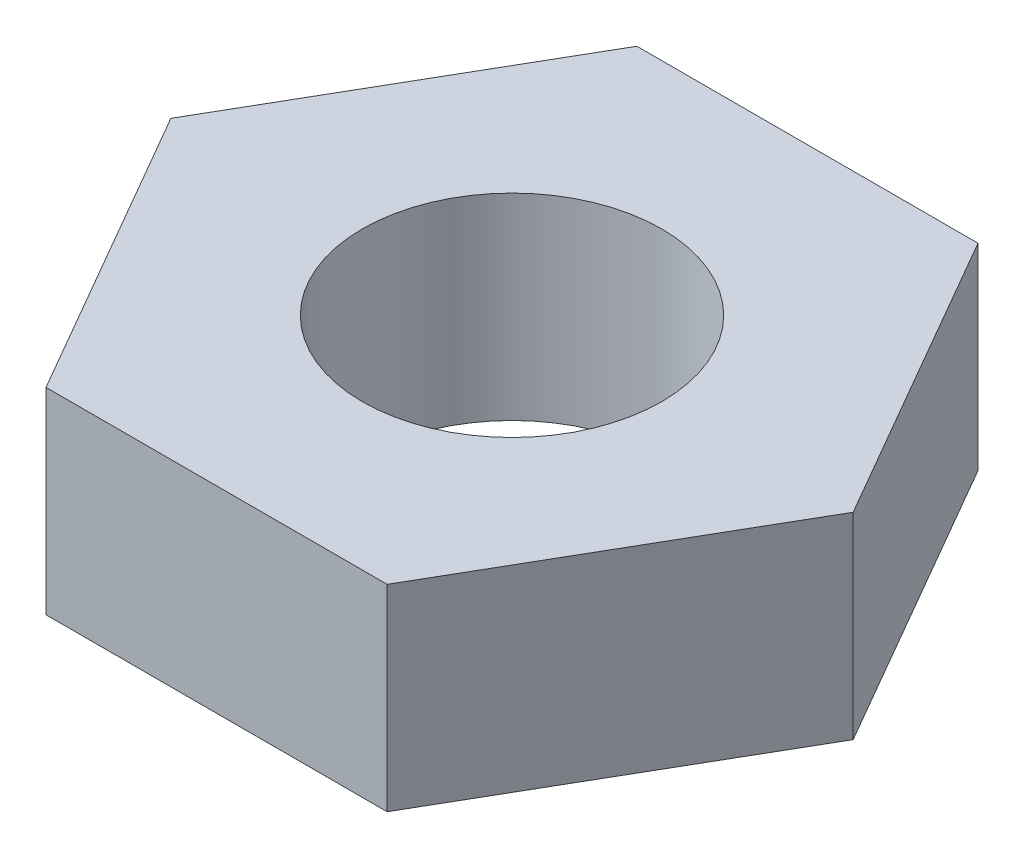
ISO-10303-21;
HEADER;
FILE_DESCRIPTION(('STEP AP214'),'2;1');
FILE_NAME('part.step','',(''),(''),'','','');
FILE_SCHEMA(('AUTOMOTIVE_DESIGN { 1 0 10303 214 1 1 1 1 }'));
ENDSEC;
DATA;
#1=APPLICATION_CONTEXT('core data for automotive mechanical design processes');
#2=APPLICATION_PROTOCOL_DEFINITION('international standard','automotive_design',2000,#1);
#3=PRODUCT_CONTEXT('',#1,'mechanical');
#4=PRODUCT('Part','Part','',(#3));
#5=PRODUCT_RELATED_PRODUCT_CATEGORY('part','',(#4));
#6=PRODUCT_DEFINITION_FORMATION('','',#4);
#7=PRODUCT_DEFINITION_CONTEXT('part definition',#1,'design');
#8=PRODUCT_DEFINITION('design','',#6,#7);
#9=PRODUCT_DEFINITION_SHAPE('','',#8);
#10=(LENGTH_UNIT() NAMED_UNIT(*) SI_UNIT(.MILLI.,.METRE.));
#11=(NAMED_UNIT(*) PLANE_ANGLE_UNIT() SI_UNIT($,.RADIAN.));
#12=(NAMED_UNIT(*) SI_UNIT($,.STERADIAN.) SOLID_ANGLE_UNIT());
#13=UNCERTAINTY_MEASURE_WITH_UNIT(LENGTH_MEASURE(1.E-05),#10,'distance_accuracy_value','');
#14=(GEOMETRIC_REPRESENTATION_CONTEXT(3) GLOBAL_UNCERTAINTY_ASSIGNED_CONTEXT((#13)) GLOBAL_UNIT_ASSIGNED_CONTEXT((#10,
#11,#12)) REPRESENTATION_CONTEXT('',''));
#15=CARTESIAN_POINT('',(0.,0.,0.));
#16=DIRECTION('',(0.,0.,1.));
#17=DIRECTION('',(1.,0.,0.));
#18=AXIS2_PLACEMENT_3D('',#15,#16,#17);
#19=CARTESIAN_POINT('',(0.,1.5875,0.));
#20=DIRECTION('',(0.,1.,0.));
#21=DIRECTION('',(0.,0.,1.));
#22=AXIS2_PLACEMENT_3D('',#19,#20,#21);
#23=PLANE('',#22);
#24=DIRECTION('',(0.499999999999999,0.,-0.866025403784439));
#25=VECTOR('',#24,1.);
#26=CARTESIAN_POINT('',(2.7496306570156,1.5875,4.7625));
#27=LINE('',#26,#25);
#28=CARTESIAN_POINT('',(2.7496306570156,1.5875,4.7625));
#29=VERTEX_POINT('',#28);
#30=CARTESIAN_POINT('',(5.49926131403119,1.5875,0.));
#31=VERTEX_POINT('',#30);
#32=EDGE_CURVE('E129',#29,#31,#27,.T.);
#33=ORIENTED_EDGE('',*,*,#32,.T.);
#34=DIRECTION('',(-0.5,0.,-0.866025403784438));
#35=VECTOR('',#34,1.);
#36=CARTESIAN_POINT('',(5.49926131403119,1.5875,0.));
#37=LINE('',#36,#35);
#38=CARTESIAN_POINT('',(2.74963065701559,1.5875,-4.7625));
#39=VERTEX_POINT('',#38);
#40=EDGE_CURVE('E87',#31,#39,#37,.T.);
#41=ORIENTED_EDGE('',*,*,#40,.T.);
#42=DIRECTION('',(-1.,0.,0.));
#43=VECTOR('',#42,1.);
#44=CARTESIAN_POINT('',(2.74963065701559,1.5875,-4.7625));
#45=LINE('',#44,#43);
#46=CARTESIAN_POINT('',(-2.74963065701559,1.5875,-4.7625));
#47=VERTEX_POINT('',#46);
#48=EDGE_CURVE('E100',#39,#47,#45,.T.);
#49=ORIENTED_EDGE('',*,*,#48,.T.);
#50=DIRECTION('',(-0.499999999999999,0.,0.866025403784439));
#51=VECTOR('',#50,1.);
#52=CARTESIAN_POINT('',(-2.74963065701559,1.5875,-4.7625));
#53=LINE('',#52,#51);
#54=CARTESIAN_POINT('',(-5.49926131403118,1.5875,0.));
#55=VERTEX_POINT('',#54);
#56=EDGE_CURVE('E94',#47,#55,#53,.T.);
#57=ORIENTED_EDGE('',*,*,#56,.T.);
#58=DIRECTION('',(0.5,0.,0.866025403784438));
#59=VECTOR('',#58,1.);
#60=CARTESIAN_POINT('',(-5.49926131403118,1.5875,0.));
#61=LINE('',#60,#59);
#62=CARTESIAN_POINT('',(-2.74963065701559,1.5875,4.7625));
#63=VERTEX_POINT('',#62);
#64=EDGE_CURVE('E98',#55,#63,#61,.T.);
#65=ORIENTED_EDGE('',*,*,#64,.T.);
#66=DIRECTION('',(1.,0.,0.));
#67=VECTOR('',#66,1.);
#68=CARTESIAN_POINT('',(-2.74963065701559,1.5875,4.7625));
#69=LINE('',#68,#67);
#70=EDGE_CURVE('E50',#63,#29,#69,.T.);
#71=ORIENTED_EDGE('',*,*,#70,.T.);
#72=EDGE_LOOP('',(#33,#41,#49,#57,#65,#71));
#73=FACE_BOUND('',#72,.T.);
#74=CARTESIAN_POINT('',(0.,1.5875,0.));
#75=DIRECTION('',(0.,1.,0.));
#76=DIRECTION('',(0.,0.,1.));
#77=AXIS2_PLACEMENT_3D('',#74,#75,#76);
#78=CIRCLE('',#77,2.413);
#79=CARTESIAN_POINT('',(0.,1.5875,2.413));
#80=VERTEX_POINT('',#79);
#81=EDGE_CURVE('E122',#80,#80,#78,.T.);
#82=ORIENTED_EDGE('',*,*,#81,.F.);
#83=EDGE_LOOP('',(#82));
#84=FACE_BOUND('',#83,.T.);
#85=ADVANCED_FACE('F33',(#73,#84),#23,.T.);
#86=CARTESIAN_POINT('',(0.,-1.5875,0.));
#87=DIRECTION('',(0.,1.,0.));
#88=DIRECTION('',(0.,0.,1.));
#89=AXIS2_PLACEMENT_3D('',#86,#87,#88);
#90=PLANE('',#89);
#91=DIRECTION('',(0.499999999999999,0.,-0.866025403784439));
#92=VECTOR('',#91,1.);
#93=CARTESIAN_POINT('',(2.7496306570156,-1.5875,4.7625));
#94=LINE('',#93,#92);
#95=CARTESIAN_POINT('',(2.7496306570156,-1.5875,4.7625));
#96=VERTEX_POINT('',#95);
#97=CARTESIAN_POINT('',(5.49926131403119,-1.5875,0.));
#98=VERTEX_POINT('',#97);
#99=EDGE_CURVE('E118',#96,#98,#94,.T.);
#100=ORIENTED_EDGE('',*,*,#99,.F.);
#101=DIRECTION('',(1.,0.,0.));
#102=VECTOR('',#101,1.);
#103=CARTESIAN_POINT('',(-2.74963065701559,-1.5875,4.7625));
#104=LINE('',#103,#102);
#105=CARTESIAN_POINT('',(-2.74963065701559,-1.5875,4.7625));
#106=VERTEX_POINT('',#105);
#107=EDGE_CURVE('E79',#106,#96,#104,.T.);
#108=ORIENTED_EDGE('',*,*,#107,.F.);
#109=DIRECTION('',(0.5,0.,0.866025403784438));
#110=VECTOR('',#109,1.);
#111=CARTESIAN_POINT('',(-5.49926131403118,-1.5875,0.));
#112=LINE('',#111,#110);
#113=CARTESIAN_POINT('',(-5.49926131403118,-1.5875,0.));
#114=VERTEX_POINT('',#113);
#115=EDGE_CURVE('E73',#114,#106,#112,.T.);
#116=ORIENTED_EDGE('',*,*,#115,.F.);
#117=DIRECTION('',(-0.499999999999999,0.,0.866025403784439));
#118=VECTOR('',#117,1.);
#119=CARTESIAN_POINT('',(-2.74963065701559,-1.5875,-4.7625));
#120=LINE('',#119,#118);
#121=CARTESIAN_POINT('',(-2.74963065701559,-1.5875,-4.7625));
#122=VERTEX_POINT('',#121);
#123=EDGE_CURVE('E108',#122,#114,#120,.T.);
#124=ORIENTED_EDGE('',*,*,#123,.F.);
#125=DIRECTION('',(-1.,0.,0.));
#126=VECTOR('',#125,1.);
#127=CARTESIAN_POINT('',(2.74963065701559,-1.5875,-4.7625));
#128=LINE('',#127,#126);
#129=CARTESIAN_POINT('',(2.74963065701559,-1.5875,-4.7625));
#130=VERTEX_POINT('',#129);
#131=EDGE_CURVE('E124',#130,#122,#128,.T.);
#132=ORIENTED_EDGE('',*,*,#131,.F.);
#133=DIRECTION('',(-0.5,0.,-0.866025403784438));
#134=VECTOR('',#133,1.);
#135=CARTESIAN_POINT('',(5.49926131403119,-1.5875,0.));
#136=LINE('',#135,#134);
#137=EDGE_CURVE('E121',#98,#130,#136,.T.);
#138=ORIENTED_EDGE('',*,*,#137,.F.);
#139=EDGE_LOOP('',(#100,#108,#116,#124,#132,#138));
#140=FACE_BOUND('',#139,.T.);
#141=CARTESIAN_POINT('',(0.,-1.5875,0.));
#142=DIRECTION('',(0.,1.,0.));
#143=DIRECTION('',(0.,0.,1.));
#144=AXIS2_PLACEMENT_3D('',#141,#142,#143);
#145=CIRCLE('',#144,2.413);
#146=CARTESIAN_POINT('',(0.,-1.5875,2.413));
#147=VERTEX_POINT('',#146);
#148=EDGE_CURVE('E222',#147,#147,#145,.T.);
#149=ORIENTED_EDGE('',*,*,#148,.T.);
#150=EDGE_LOOP('',(#149));
#151=FACE_BOUND('',#150,.T.);
#152=ADVANCED_FACE('F138',(#140,#151),#90,.F.);
#153=CARTESIAN_POINT('',(2.7496306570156,1.5875,4.7625));
#154=DIRECTION('',(-0.866025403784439,0.,-0.499999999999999));
#155=DIRECTION('',(-0.499999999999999,0.,0.866025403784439));
#156=AXIS2_PLACEMENT_3D('',#153,#154,#155);
#157=PLANE('',#156);
#158=ORIENTED_EDGE('',*,*,#99,.T.);
#159=DIRECTION('',(0.,-1.,0.));
#160=VECTOR('',#159,1.);
#161=CARTESIAN_POINT('',(5.49926131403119,1.5875,0.));
#162=LINE('',#161,#160);
#163=EDGE_CURVE('E11',#31,#98,#162,.T.);
#164=ORIENTED_EDGE('',*,*,#163,.F.);
#165=ORIENTED_EDGE('',*,*,#32,.F.);
#166=DIRECTION('',(0.,-1.,0.));
#167=VECTOR('',#166,1.);
#168=CARTESIAN_POINT('',(2.7496306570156,1.5875,4.7625));
#169=LINE('',#168,#167);
#170=EDGE_CURVE('E114',#29,#96,#169,.T.);
#171=ORIENTED_EDGE('',*,*,#170,.T.);
#172=EDGE_LOOP('',(#158,#164,#165,#171));
#173=FACE_BOUND('',#172,.T.);
#174=ADVANCED_FACE('F35',(#173),#157,.F.);
#175=CARTESIAN_POINT('',(5.49926131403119,1.5875,0.));
#176=DIRECTION('',(-0.866025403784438,0.,0.5));
#177=DIRECTION('',(0.5,0.,0.866025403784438));
#178=AXIS2_PLACEMENT_3D('',#175,#176,#177);
#179=PLANE('',#178);
#180=ORIENTED_EDGE('',*,*,#137,.T.);
#181=DIRECTION('',(0.,-1.,0.));
#182=VECTOR('',#181,1.);
#183=CARTESIAN_POINT('',(2.74963065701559,1.5875,-4.7625));
#184=LINE('',#183,#182);
#185=EDGE_CURVE('E42',#39,#130,#184,.T.);
#186=ORIENTED_EDGE('',*,*,#185,.F.);
#187=ORIENTED_EDGE('',*,*,#40,.F.);
#188=ORIENTED_EDGE('',*,*,#163,.T.);
#189=EDGE_LOOP('',(#180,#186,#187,#188));
#190=FACE_BOUND('',#189,.T.);
#191=ADVANCED_FACE('F163',(#190),#179,.F.);
#192=CARTESIAN_POINT('',(2.74963065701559,1.5875,-4.7625));
#193=DIRECTION('',(0.,0.,1.));
#194=DIRECTION('',(1.,0.,0.));
#195=AXIS2_PLACEMENT_3D('',#192,#193,#194);
#196=PLANE('',#195);
#197=ORIENTED_EDGE('',*,*,#131,.T.);
#198=DIRECTION('',(0.,-1.,0.));
#199=VECTOR('',#198,1.);
#200=CARTESIAN_POINT('',(-2.74963065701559,1.5875,-4.7625));
#201=LINE('',#200,#199);
#202=EDGE_CURVE('E109',#47,#122,#201,.T.);
#203=ORIENTED_EDGE('',*,*,#202,.F.);
#204=ORIENTED_EDGE('',*,*,#48,.F.);
#205=ORIENTED_EDGE('',*,*,#185,.T.);
#206=EDGE_LOOP('',(#197,#203,#204,#205));
#207=FACE_BOUND('',#206,.T.);
#208=ADVANCED_FACE('F135',(#207),#196,.F.);
#209=CARTESIAN_POINT('',(-2.74963065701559,1.5875,-4.7625));
#210=DIRECTION('',(0.866025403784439,0.,0.499999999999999));
#211=DIRECTION('',(0.499999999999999,0.,-0.866025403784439));
#212=AXIS2_PLACEMENT_3D('',#209,#210,#211);
#213=PLANE('',#212);
#214=ORIENTED_EDGE('',*,*,#123,.T.);
#215=DIRECTION('',(0.,-1.,0.));
#216=VECTOR('',#215,1.);
#217=CARTESIAN_POINT('',(-5.49926131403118,1.5875,0.));
#218=LINE('',#217,#216);
#219=EDGE_CURVE('E105',#55,#114,#218,.T.);
#220=ORIENTED_EDGE('',*,*,#219,.F.);
#221=ORIENTED_EDGE('',*,*,#56,.F.);
#222=ORIENTED_EDGE('',*,*,#202,.T.);
#223=EDGE_LOOP('',(#214,#220,#221,#222));
#224=FACE_BOUND('',#223,.T.);
#225=ADVANCED_FACE('F106',(#224),#213,.F.);
#226=CARTESIAN_POINT('',(-5.49926131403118,1.5875,0.));
#227=DIRECTION('',(0.866025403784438,0.,-0.5));
#228=DIRECTION('',(-0.5,0.,-0.866025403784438));
#229=AXIS2_PLACEMENT_3D('',#226,#227,#228);
#230=PLANE('',#229);
#231=ORIENTED_EDGE('',*,*,#115,.T.);
#232=DIRECTION('',(0.,-1.,0.));
#233=VECTOR('',#232,1.);
#234=CARTESIAN_POINT('',(-2.74963065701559,1.5875,4.7625));
#235=LINE('',#234,#233);
#236=EDGE_CURVE('E110',#63,#106,#235,.T.);
#237=ORIENTED_EDGE('',*,*,#236,.F.);
#238=ORIENTED_EDGE('',*,*,#64,.F.);
#239=ORIENTED_EDGE('',*,*,#219,.T.);
#240=EDGE_LOOP('',(#231,#237,#238,#239));
#241=FACE_BOUND('',#240,.T.);
#242=ADVANCED_FACE('F112',(#241),#230,.F.);
#243=CARTESIAN_POINT('',(-2.74963065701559,1.5875,4.7625));
#244=DIRECTION('',(0.,0.,-1.));
#245=DIRECTION('',(-1.,0.,0.));
#246=AXIS2_PLACEMENT_3D('',#243,#244,#245);
#247=PLANE('',#246);
#248=ORIENTED_EDGE('',*,*,#107,.T.);
#249=ORIENTED_EDGE('',*,*,#170,.F.);
#250=ORIENTED_EDGE('',*,*,#70,.F.);
#251=ORIENTED_EDGE('',*,*,#236,.T.);
#252=EDGE_LOOP('',(#248,#249,#250,#251));
#253=FACE_BOUND('',#252,.T.);
#254=ADVANCED_FACE('F143',(#253),#247,.F.);
#255=CARTESIAN_POINT('',(0.,1.5875,0.));
#256=DIRECTION('',(0.,-1.,0.));
#257=DIRECTION('',(0.,0.,-1.));
#258=AXIS2_PLACEMENT_3D('',#255,#256,#257);
#259=CYLINDRICAL_SURFACE('',#258,2.413);
#260=ORIENTED_EDGE('',*,*,#81,.T.);
#261=EDGE_LOOP('',(#260));
#262=FACE_BOUND('',#261,.T.);
#263=ORIENTED_EDGE('',*,*,#148,.F.);
#264=EDGE_LOOP('',(#263));
#265=FACE_BOUND('',#264,.T.);
#266=ADVANCED_FACE('F145',(#262,#265),#259,.F.);
#267=CLOSED_SHELL('',(#85,#152,#174,#191,#208,#225,#242,#254,#266));
#268=MANIFOLD_SOLID_BREP('B2',#267);
#269=ADVANCED_BREP_SHAPE_REPRESENTATION('',(#18,#268),#14);
#270=SHAPE_DEFINITION_REPRESENTATION(#9,#269);
ENDSEC;
END-ISO-10303-21;
